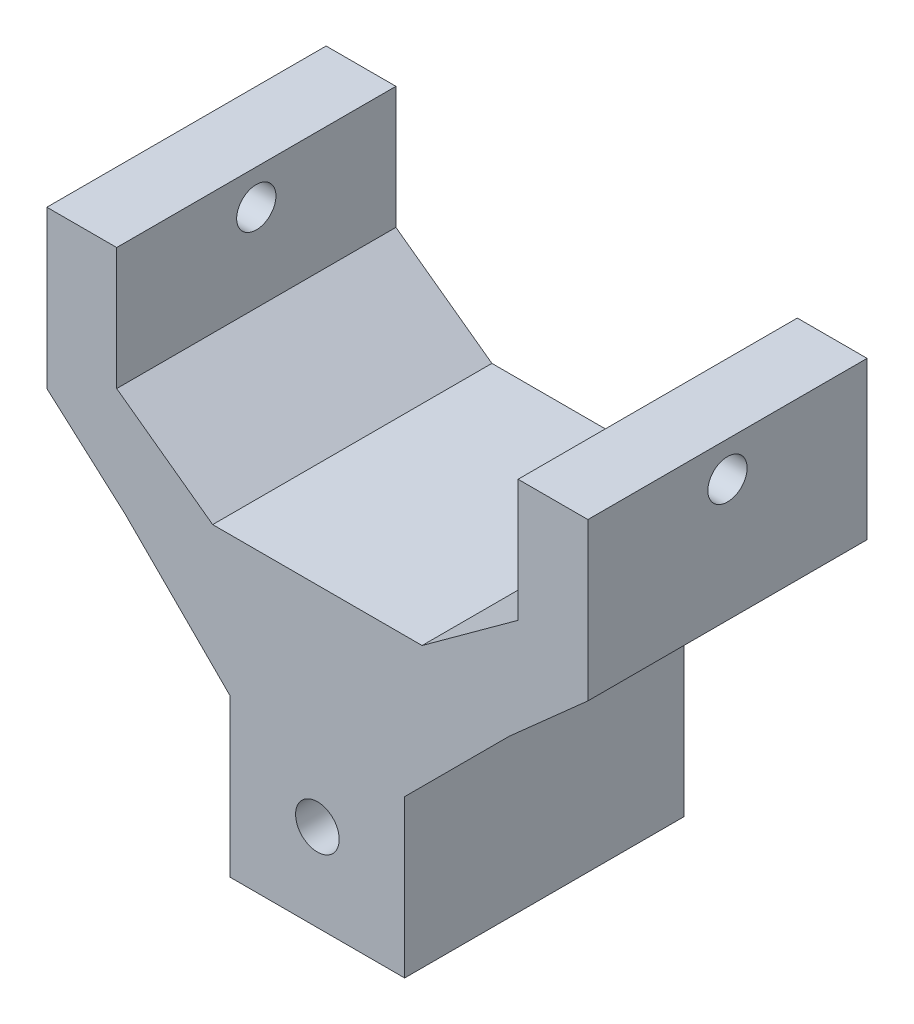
ISO-10303-21;
HEADER;
FILE_DESCRIPTION(('STEP AP214'),'2;1');
FILE_NAME('part.step','',(''),(''),'','','');
FILE_SCHEMA(('AUTOMOTIVE_DESIGN { 1 0 10303 214 1 1 1 1 }'));
ENDSEC;
DATA;
#1=APPLICATION_CONTEXT('core data for automotive mechanical design processes');
#2=APPLICATION_PROTOCOL_DEFINITION('international standard','automotive_design',2000,#1);
#3=PRODUCT_CONTEXT('',#1,'mechanical');
#4=PRODUCT('Part','Part','',(#3));
#5=PRODUCT_RELATED_PRODUCT_CATEGORY('part','',(#4));
#6=PRODUCT_DEFINITION_FORMATION('','',#4);
#7=PRODUCT_DEFINITION_CONTEXT('part definition',#1,'design');
#8=PRODUCT_DEFINITION('design','',#6,#7);
#9=PRODUCT_DEFINITION_SHAPE('','',#8);
#10=(LENGTH_UNIT() NAMED_UNIT(*) SI_UNIT(.MILLI.,.METRE.));
#11=(NAMED_UNIT(*) PLANE_ANGLE_UNIT() SI_UNIT($,.RADIAN.));
#12=(NAMED_UNIT(*) SI_UNIT($,.STERADIAN.) SOLID_ANGLE_UNIT());
#13=UNCERTAINTY_MEASURE_WITH_UNIT(LENGTH_MEASURE(1.E-05),#10,'distance_accuracy_value','');
#14=(GEOMETRIC_REPRESENTATION_CONTEXT(3) GLOBAL_UNCERTAINTY_ASSIGNED_CONTEXT((#13)) GLOBAL_UNIT_ASSIGNED_CONTEXT((#10,
#11,#12)) REPRESENTATION_CONTEXT('',''));
#15=CARTESIAN_POINT('',(0.,0.,0.));
#16=DIRECTION('',(0.,0.,1.));
#17=DIRECTION('',(1.,0.,0.));
#18=AXIS2_PLACEMENT_3D('',#15,#16,#17);
#19=CARTESIAN_POINT('',(-10.,-132.,-16.));
#20=DIRECTION('',(-1.,0.,0.));
#21=DIRECTION('',(0.,0.,1.));
#22=AXIS2_PLACEMENT_3D('',#19,#20,#21);
#23=PLANE('',#22);
#24=DIRECTION('',(0.,-1.,0.));
#25=VECTOR('',#24,1.);
#26=CARTESIAN_POINT('',(-10.,-132.,16.));
#27=LINE('',#26,#25);
#28=CARTESIAN_POINT('',(-10.,-132.,16.));
#29=VERTEX_POINT('',#28);
#30=CARTESIAN_POINT('',(-10.,-150.,16.));
#31=VERTEX_POINT('',#30);
#32=EDGE_CURVE('E187',#29,#31,#27,.T.);
#33=ORIENTED_EDGE('',*,*,#32,.F.);
#34=DIRECTION('',(0.,0.,1.));
#35=VECTOR('',#34,1.);
#36=CARTESIAN_POINT('',(-10.,-132.,-16.));
#37=LINE('',#36,#35);
#38=CARTESIAN_POINT('',(-10.,-132.,-16.));
#39=VERTEX_POINT('',#38);
#40=EDGE_CURVE('E11',#39,#29,#37,.T.);
#41=ORIENTED_EDGE('',*,*,#40,.F.);
#42=DIRECTION('',(0.,-1.,0.));
#43=VECTOR('',#42,1.);
#44=CARTESIAN_POINT('',(-10.,-132.,-16.));
#45=LINE('',#44,#43);
#46=CARTESIAN_POINT('',(-10.,-150.,-16.));
#47=VERTEX_POINT('',#46);
#48=EDGE_CURVE('E232',#39,#47,#45,.T.);
#49=ORIENTED_EDGE('',*,*,#48,.T.);
#50=DIRECTION('',(0.,0.,1.));
#51=VECTOR('',#50,1.);
#52=CARTESIAN_POINT('',(-10.,-150.,-16.));
#53=LINE('',#52,#51);
#54=EDGE_CURVE('E121',#47,#31,#53,.T.);
#55=ORIENTED_EDGE('',*,*,#54,.T.);
#56=EDGE_LOOP('',(#33,#41,#49,#55));
#57=FACE_BOUND('',#56,.T.);
#58=ADVANCED_FACE('F41',(#57),#23,.T.);
#59=CARTESIAN_POINT('',(-22.,-120.,-16.));
#60=DIRECTION('',(-0.707106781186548,-0.707106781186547,0.));
#61=DIRECTION('',(0.707106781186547,-0.707106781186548,0.));
#62=AXIS2_PLACEMENT_3D('',#59,#60,#61);
#63=PLANE('',#62);
#64=DIRECTION('',(0.707106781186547,-0.707106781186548,0.));
#65=VECTOR('',#64,1.);
#66=CARTESIAN_POINT('',(-22.,-120.,16.));
#67=LINE('',#66,#65);
#68=CARTESIAN_POINT('',(-22.,-120.,16.));
#69=VERTEX_POINT('',#68);
#70=EDGE_CURVE('E230',#69,#29,#67,.T.);
#71=ORIENTED_EDGE('',*,*,#70,.F.);
#72=DIRECTION('',(0.,0.,1.));
#73=VECTOR('',#72,1.);
#74=CARTESIAN_POINT('',(-22.,-120.,-16.));
#75=LINE('',#74,#73);
#76=CARTESIAN_POINT('',(-22.,-120.,-16.));
#77=VERTEX_POINT('',#76);
#78=EDGE_CURVE('E50',#77,#69,#75,.T.);
#79=ORIENTED_EDGE('',*,*,#78,.F.);
#80=DIRECTION('',(0.707106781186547,-0.707106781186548,0.));
#81=VECTOR('',#80,1.);
#82=CARTESIAN_POINT('',(-22.,-120.,-16.));
#83=LINE('',#82,#81);
#84=EDGE_CURVE('E177',#77,#39,#83,.T.);
#85=ORIENTED_EDGE('',*,*,#84,.T.);
#86=ORIENTED_EDGE('',*,*,#40,.T.);
#87=EDGE_LOOP('',(#71,#79,#85,#86));
#88=FACE_BOUND('',#87,.T.);
#89=ADVANCED_FACE('F349',(#88),#63,.T.);
#90=CARTESIAN_POINT('',(-31.,-112.,-16.));
#91=DIRECTION('',(-0.664363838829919,-0.74740931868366,0.));
#92=DIRECTION('',(0.74740931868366,-0.664363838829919,0.));
#93=AXIS2_PLACEMENT_3D('',#90,#91,#92);
#94=PLANE('',#93);
#95=DIRECTION('',(0.74740931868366,-0.664363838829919,0.));
#96=VECTOR('',#95,1.);
#97=CARTESIAN_POINT('',(-31.,-112.,16.));
#98=LINE('',#97,#96);
#99=CARTESIAN_POINT('',(-31.,-112.,16.));
#100=VERTEX_POINT('',#99);
#101=EDGE_CURVE('E164',#100,#69,#98,.T.);
#102=ORIENTED_EDGE('',*,*,#101,.F.);
#103=DIRECTION('',(0.,0.,1.));
#104=VECTOR('',#103,1.);
#105=CARTESIAN_POINT('',(-31.,-112.,-16.));
#106=LINE('',#105,#104);
#107=CARTESIAN_POINT('',(-31.,-112.,-16.));
#108=VERTEX_POINT('',#107);
#109=EDGE_CURVE('E159',#108,#100,#106,.T.);
#110=ORIENTED_EDGE('',*,*,#109,.F.);
#111=DIRECTION('',(0.74740931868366,-0.664363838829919,0.));
#112=VECTOR('',#111,1.);
#113=CARTESIAN_POINT('',(-31.,-112.,-16.));
#114=LINE('',#113,#112);
#115=EDGE_CURVE('E162',#108,#77,#114,.T.);
#116=ORIENTED_EDGE('',*,*,#115,.T.);
#117=ORIENTED_EDGE('',*,*,#78,.T.);
#118=EDGE_LOOP('',(#102,#110,#116,#117));
#119=FACE_BOUND('',#118,.T.);
#120=ADVANCED_FACE('F161',(#119),#94,.T.);
#121=CARTESIAN_POINT('',(-31.,-94.,-16.));
#122=DIRECTION('',(-1.,0.,0.));
#123=DIRECTION('',(0.,0.,1.));
#124=AXIS2_PLACEMENT_3D('',#121,#122,#123);
#125=PLANE('',#124);
#126=CARTESIAN_POINT('',(-31.,-98.,0.));
#127=DIRECTION('',(-1.,0.,0.));
#128=DIRECTION('',(0.,0.,1.));
#129=AXIS2_PLACEMENT_3D('',#126,#127,#128);
#130=CIRCLE('',#129,2.25);
#131=CARTESIAN_POINT('',(-31.,-98.,2.25));
#132=VERTEX_POINT('',#131);
#133=EDGE_CURVE('E260',#132,#132,#130,.T.);
#134=ORIENTED_EDGE('',*,*,#133,.F.);
#135=EDGE_LOOP('',(#134));
#136=FACE_BOUND('',#135,.T.);
#137=DIRECTION('',(0.,-1.,0.));
#138=VECTOR('',#137,1.);
#139=CARTESIAN_POINT('',(-31.,-94.,16.));
#140=LINE('',#139,#138);
#141=CARTESIAN_POINT('',(-31.,-94.,16.));
#142=VERTEX_POINT('',#141);
#143=EDGE_CURVE('E227',#142,#100,#140,.T.);
#144=ORIENTED_EDGE('',*,*,#143,.F.);
#145=DIRECTION('',(0.,0.,1.));
#146=VECTOR('',#145,1.);
#147=CARTESIAN_POINT('',(-31.,-94.,-16.));
#148=LINE('',#147,#146);
#149=CARTESIAN_POINT('',(-31.,-94.,-16.));
#150=VERTEX_POINT('',#149);
#151=EDGE_CURVE('E169',#150,#142,#148,.T.);
#152=ORIENTED_EDGE('',*,*,#151,.F.);
#153=DIRECTION('',(0.,-1.,0.));
#154=VECTOR('',#153,1.);
#155=CARTESIAN_POINT('',(-31.,-94.,-16.));
#156=LINE('',#155,#154);
#157=EDGE_CURVE('E175',#150,#108,#156,.T.);
#158=ORIENTED_EDGE('',*,*,#157,.T.);
#159=ORIENTED_EDGE('',*,*,#109,.T.);
#160=EDGE_LOOP('',(#144,#152,#158,#159));
#161=FACE_BOUND('',#160,.T.);
#162=ADVANCED_FACE('F179',(#136,#161),#125,.T.);
#163=CARTESIAN_POINT('',(-23.,-94.,-16.));
#164=DIRECTION('',(0.,1.,0.));
#165=DIRECTION('',(0.,0.,1.));
#166=AXIS2_PLACEMENT_3D('',#163,#164,#165);
#167=PLANE('',#166);
#168=DIRECTION('',(-1.,0.,0.));
#169=VECTOR('',#168,1.);
#170=CARTESIAN_POINT('',(-23.,-94.,16.));
#171=LINE('',#170,#169);
#172=CARTESIAN_POINT('',(-23.,-94.,16.));
#173=VERTEX_POINT('',#172);
#174=EDGE_CURVE('E224',#173,#142,#171,.T.);
#175=ORIENTED_EDGE('',*,*,#174,.F.);
#176=DIRECTION('',(0.,0.,1.));
#177=VECTOR('',#176,1.);
#178=CARTESIAN_POINT('',(-23.,-94.,-16.));
#179=LINE('',#178,#177);
#180=CARTESIAN_POINT('',(-23.,-94.,-16.));
#181=VERTEX_POINT('',#180);
#182=EDGE_CURVE('E236',#181,#173,#179,.T.);
#183=ORIENTED_EDGE('',*,*,#182,.F.);
#184=DIRECTION('',(-1.,0.,0.));
#185=VECTOR('',#184,1.);
#186=CARTESIAN_POINT('',(-23.,-94.,-16.));
#187=LINE('',#186,#185);
#188=EDGE_CURVE('E180',#181,#150,#187,.T.);
#189=ORIENTED_EDGE('',*,*,#188,.T.);
#190=ORIENTED_EDGE('',*,*,#151,.T.);
#191=EDGE_LOOP('',(#175,#183,#189,#190));
#192=FACE_BOUND('',#191,.T.);
#193=ADVANCED_FACE('F362',(#192),#167,.T.);
#194=CARTESIAN_POINT('',(-23.,-108.,-16.));
#195=DIRECTION('',(1.,0.,0.));
#196=DIRECTION('',(0.,0.,-1.));
#197=AXIS2_PLACEMENT_3D('',#194,#195,#196);
#198=PLANE('',#197);
#199=CARTESIAN_POINT('',(-23.,-98.,0.));
#200=DIRECTION('',(1.,0.,0.));
#201=DIRECTION('',(0.,0.,-1.));
#202=AXIS2_PLACEMENT_3D('',#199,#200,#201);
#203=CIRCLE('',#202,2.25);
#204=CARTESIAN_POINT('',(-23.,-98.,-2.25));
#205=VERTEX_POINT('',#204);
#206=EDGE_CURVE('E266',#205,#205,#203,.T.);
#207=ORIENTED_EDGE('',*,*,#206,.F.);
#208=EDGE_LOOP('',(#207));
#209=FACE_BOUND('',#208,.T.);
#210=DIRECTION('',(0.,1.,0.));
#211=VECTOR('',#210,1.);
#212=CARTESIAN_POINT('',(-23.,-108.,16.));
#213=LINE('',#212,#211);
#214=CARTESIAN_POINT('',(-23.,-108.,16.));
#215=VERTEX_POINT('',#214);
#216=EDGE_CURVE('E221',#215,#173,#213,.T.);
#217=ORIENTED_EDGE('',*,*,#216,.F.);
#218=DIRECTION('',(0.,0.,1.));
#219=VECTOR('',#218,1.);
#220=CARTESIAN_POINT('',(-23.,-108.,-16.));
#221=LINE('',#220,#219);
#222=CARTESIAN_POINT('',(-23.,-108.,-16.));
#223=VERTEX_POINT('',#222);
#224=EDGE_CURVE('E238',#223,#215,#221,.T.);
#225=ORIENTED_EDGE('',*,*,#224,.F.);
#226=DIRECTION('',(0.,1.,0.));
#227=VECTOR('',#226,1.);
#228=CARTESIAN_POINT('',(-23.,-108.,-16.));
#229=LINE('',#228,#227);
#230=EDGE_CURVE('E182',#223,#181,#229,.T.);
#231=ORIENTED_EDGE('',*,*,#230,.T.);
#232=ORIENTED_EDGE('',*,*,#182,.T.);
#233=EDGE_LOOP('',(#217,#225,#231,#232));
#234=FACE_BOUND('',#233,.T.);
#235=ADVANCED_FACE('F308',(#209,#234),#198,.T.);
#236=CARTESIAN_POINT('',(-12.,-116.,-16.));
#237=DIRECTION('',(0.588171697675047,0.808736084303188,0.));
#238=DIRECTION('',(-0.808736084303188,0.588171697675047,0.));
#239=AXIS2_PLACEMENT_3D('',#236,#237,#238);
#240=PLANE('',#239);
#241=DIRECTION('',(-0.808736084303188,0.588171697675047,0.));
#242=VECTOR('',#241,1.);
#243=CARTESIAN_POINT('',(-12.,-116.,16.));
#244=LINE('',#243,#242);
#245=CARTESIAN_POINT('',(-12.,-116.,16.));
#246=VERTEX_POINT('',#245);
#247=EDGE_CURVE('E218',#246,#215,#244,.T.);
#248=ORIENTED_EDGE('',*,*,#247,.F.);
#249=DIRECTION('',(0.,0.,1.));
#250=VECTOR('',#249,1.);
#251=CARTESIAN_POINT('',(-12.,-116.,-16.));
#252=LINE('',#251,#250);
#253=CARTESIAN_POINT('',(-12.,-116.,-16.));
#254=VERTEX_POINT('',#253);
#255=EDGE_CURVE('E240',#254,#246,#252,.T.);
#256=ORIENTED_EDGE('',*,*,#255,.F.);
#257=DIRECTION('',(-0.808736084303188,0.588171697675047,0.));
#258=VECTOR('',#257,1.);
#259=CARTESIAN_POINT('',(-12.,-116.,-16.));
#260=LINE('',#259,#258);
#261=EDGE_CURVE('E302',#254,#223,#260,.T.);
#262=ORIENTED_EDGE('',*,*,#261,.T.);
#263=ORIENTED_EDGE('',*,*,#224,.T.);
#264=EDGE_LOOP('',(#248,#256,#262,#263));
#265=FACE_BOUND('',#264,.T.);
#266=ADVANCED_FACE('F314',(#265),#240,.T.);
#267=CARTESIAN_POINT('',(12.,-116.,-16.));
#268=DIRECTION('',(0.,1.,0.));
#269=DIRECTION('',(0.,0.,1.));
#270=AXIS2_PLACEMENT_3D('',#267,#268,#269);
#271=PLANE('',#270);
#272=DIRECTION('',(-1.,0.,0.));
#273=VECTOR('',#272,1.);
#274=CARTESIAN_POINT('',(12.,-116.,16.));
#275=LINE('',#274,#273);
#276=CARTESIAN_POINT('',(12.,-116.,16.));
#277=VERTEX_POINT('',#276);
#278=EDGE_CURVE('E215',#277,#246,#275,.T.);
#279=ORIENTED_EDGE('',*,*,#278,.F.);
#280=DIRECTION('',(0.,0.,1.));
#281=VECTOR('',#280,1.);
#282=CARTESIAN_POINT('',(12.,-116.,-16.));
#283=LINE('',#282,#281);
#284=CARTESIAN_POINT('',(12.,-116.,-16.));
#285=VERTEX_POINT('',#284);
#286=EDGE_CURVE('E242',#285,#277,#283,.T.);
#287=ORIENTED_EDGE('',*,*,#286,.F.);
#288=DIRECTION('',(-1.,0.,0.));
#289=VECTOR('',#288,1.);
#290=CARTESIAN_POINT('',(12.,-116.,-16.));
#291=LINE('',#290,#289);
#292=EDGE_CURVE('E299',#285,#254,#291,.T.);
#293=ORIENTED_EDGE('',*,*,#292,.T.);
#294=ORIENTED_EDGE('',*,*,#255,.T.);
#295=EDGE_LOOP('',(#279,#287,#293,#294));
#296=FACE_BOUND('',#295,.T.);
#297=ADVANCED_FACE('F317',(#296),#271,.T.);
#298=CARTESIAN_POINT('',(23.,-108.,-16.));
#299=DIRECTION('',(-0.588171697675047,0.808736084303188,0.));
#300=DIRECTION('',(-0.808736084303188,-0.588171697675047,0.));
#301=AXIS2_PLACEMENT_3D('',#298,#299,#300);
#302=PLANE('',#301);
#303=DIRECTION('',(-0.808736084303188,-0.588171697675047,0.));
#304=VECTOR('',#303,1.);
#305=CARTESIAN_POINT('',(23.,-108.,16.));
#306=LINE('',#305,#304);
#307=CARTESIAN_POINT('',(23.,-108.,16.));
#308=VERTEX_POINT('',#307);
#309=EDGE_CURVE('E212',#308,#277,#306,.T.);
#310=ORIENTED_EDGE('',*,*,#309,.F.);
#311=DIRECTION('',(0.,0.,1.));
#312=VECTOR('',#311,1.);
#313=CARTESIAN_POINT('',(23.,-108.,-16.));
#314=LINE('',#313,#312);
#315=CARTESIAN_POINT('',(23.,-108.,-16.));
#316=VERTEX_POINT('',#315);
#317=EDGE_CURVE('E244',#316,#308,#314,.T.);
#318=ORIENTED_EDGE('',*,*,#317,.F.);
#319=DIRECTION('',(-0.808736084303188,-0.588171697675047,0.));
#320=VECTOR('',#319,1.);
#321=CARTESIAN_POINT('',(23.,-108.,-16.));
#322=LINE('',#321,#320);
#323=EDGE_CURVE('E296',#316,#285,#322,.T.);
#324=ORIENTED_EDGE('',*,*,#323,.T.);
#325=ORIENTED_EDGE('',*,*,#286,.T.);
#326=EDGE_LOOP('',(#310,#318,#324,#325));
#327=FACE_BOUND('',#326,.T.);
#328=ADVANCED_FACE('F322',(#327),#302,.T.);
#329=CARTESIAN_POINT('',(23.,-94.,-16.));
#330=DIRECTION('',(-1.,0.,0.));
#331=DIRECTION('',(0.,0.,1.));
#332=AXIS2_PLACEMENT_3D('',#329,#330,#331);
#333=PLANE('',#332);
#334=CARTESIAN_POINT('',(23.,-98.,0.));
#335=DIRECTION('',(-1.,0.,0.));
#336=DIRECTION('',(0.,0.,1.));
#337=AXIS2_PLACEMENT_3D('',#334,#335,#336);
#338=CIRCLE('',#337,2.25);
#339=CARTESIAN_POINT('',(23.,-98.,2.25));
#340=VERTEX_POINT('',#339);
#341=EDGE_CURVE('E271',#340,#340,#338,.T.);
#342=ORIENTED_EDGE('',*,*,#341,.F.);
#343=EDGE_LOOP('',(#342));
#344=FACE_BOUND('',#343,.T.);
#345=DIRECTION('',(0.,-1.,0.));
#346=VECTOR('',#345,1.);
#347=CARTESIAN_POINT('',(23.,-94.,16.));
#348=LINE('',#347,#346);
#349=CARTESIAN_POINT('',(23.,-94.,16.));
#350=VERTEX_POINT('',#349);
#351=EDGE_CURVE('E209',#350,#308,#348,.T.);
#352=ORIENTED_EDGE('',*,*,#351,.F.);
#353=DIRECTION('',(0.,0.,1.));
#354=VECTOR('',#353,1.);
#355=CARTESIAN_POINT('',(23.,-94.,-16.));
#356=LINE('',#355,#354);
#357=CARTESIAN_POINT('',(23.,-94.,-16.));
#358=VERTEX_POINT('',#357);
#359=EDGE_CURVE('E246',#358,#350,#356,.T.);
#360=ORIENTED_EDGE('',*,*,#359,.F.);
#361=DIRECTION('',(0.,-1.,0.));
#362=VECTOR('',#361,1.);
#363=CARTESIAN_POINT('',(23.,-94.,-16.));
#364=LINE('',#363,#362);
#365=EDGE_CURVE('E293',#358,#316,#364,.T.);
#366=ORIENTED_EDGE('',*,*,#365,.T.);
#367=ORIENTED_EDGE('',*,*,#317,.T.);
#368=EDGE_LOOP('',(#352,#360,#366,#367));
#369=FACE_BOUND('',#368,.T.);
#370=ADVANCED_FACE('F325',(#344,#369),#333,.T.);
#371=CARTESIAN_POINT('',(31.,-94.,-16.));
#372=DIRECTION('',(0.,1.,0.));
#373=DIRECTION('',(0.,0.,1.));
#374=AXIS2_PLACEMENT_3D('',#371,#372,#373);
#375=PLANE('',#374);
#376=DIRECTION('',(-1.,0.,0.));
#377=VECTOR('',#376,1.);
#378=CARTESIAN_POINT('',(31.,-94.,16.));
#379=LINE('',#378,#377);
#380=CARTESIAN_POINT('',(31.,-94.,16.));
#381=VERTEX_POINT('',#380);
#382=EDGE_CURVE('E206',#381,#350,#379,.T.);
#383=ORIENTED_EDGE('',*,*,#382,.F.);
#384=DIRECTION('',(0.,0.,1.));
#385=VECTOR('',#384,1.);
#386=CARTESIAN_POINT('',(31.,-94.,-16.));
#387=LINE('',#386,#385);
#388=CARTESIAN_POINT('',(31.,-94.,-16.));
#389=VERTEX_POINT('',#388);
#390=EDGE_CURVE('E248',#389,#381,#387,.T.);
#391=ORIENTED_EDGE('',*,*,#390,.F.);
#392=DIRECTION('',(-1.,0.,0.));
#393=VECTOR('',#392,1.);
#394=CARTESIAN_POINT('',(31.,-94.,-16.));
#395=LINE('',#394,#393);
#396=EDGE_CURVE('E290',#389,#358,#395,.T.);
#397=ORIENTED_EDGE('',*,*,#396,.T.);
#398=ORIENTED_EDGE('',*,*,#359,.T.);
#399=EDGE_LOOP('',(#383,#391,#397,#398));
#400=FACE_BOUND('',#399,.T.);
#401=ADVANCED_FACE('F330',(#400),#375,.T.);
#402=CARTESIAN_POINT('',(31.,-112.,-16.));
#403=DIRECTION('',(1.,0.,0.));
#404=DIRECTION('',(0.,0.,-1.));
#405=AXIS2_PLACEMENT_3D('',#402,#403,#404);
#406=PLANE('',#405);
#407=CARTESIAN_POINT('',(31.,-98.,0.));
#408=DIRECTION('',(1.,0.,0.));
#409=DIRECTION('',(0.,0.,-1.));
#410=AXIS2_PLACEMENT_3D('',#407,#408,#409);
#411=CIRCLE('',#410,2.25);
#412=CARTESIAN_POINT('',(31.,-98.,-2.25));
#413=VERTEX_POINT('',#412);
#414=EDGE_CURVE('E44',#413,#413,#411,.T.);
#415=ORIENTED_EDGE('',*,*,#414,.F.);
#416=EDGE_LOOP('',(#415));
#417=FACE_BOUND('',#416,.T.);
#418=DIRECTION('',(0.,1.,0.));
#419=VECTOR('',#418,1.);
#420=CARTESIAN_POINT('',(31.,-112.,16.));
#421=LINE('',#420,#419);
#422=CARTESIAN_POINT('',(31.,-112.,16.));
#423=VERTEX_POINT('',#422);
#424=EDGE_CURVE('E203',#423,#381,#421,.T.);
#425=ORIENTED_EDGE('',*,*,#424,.F.);
#426=DIRECTION('',(0.,0.,1.));
#427=VECTOR('',#426,1.);
#428=CARTESIAN_POINT('',(31.,-112.,-16.));
#429=LINE('',#428,#427);
#430=CARTESIAN_POINT('',(31.,-112.,-16.));
#431=VERTEX_POINT('',#430);
#432=EDGE_CURVE('E250',#431,#423,#429,.T.);
#433=ORIENTED_EDGE('',*,*,#432,.F.);
#434=DIRECTION('',(0.,1.,0.));
#435=VECTOR('',#434,1.);
#436=CARTESIAN_POINT('',(31.,-112.,-16.));
#437=LINE('',#436,#435);
#438=EDGE_CURVE('E287',#431,#389,#437,.T.);
#439=ORIENTED_EDGE('',*,*,#438,.T.);
#440=ORIENTED_EDGE('',*,*,#390,.T.);
#441=EDGE_LOOP('',(#425,#433,#439,#440));
#442=FACE_BOUND('',#441,.T.);
#443=ADVANCED_FACE('F333',(#417,#442),#406,.T.);
#444=CARTESIAN_POINT('',(22.,-120.,-16.));
#445=DIRECTION('',(0.664363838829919,-0.74740931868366,0.));
#446=DIRECTION('',(0.74740931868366,0.664363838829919,0.));
#447=AXIS2_PLACEMENT_3D('',#444,#445,#446);
#448=PLANE('',#447);
#449=DIRECTION('',(0.74740931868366,0.664363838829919,0.));
#450=VECTOR('',#449,1.);
#451=CARTESIAN_POINT('',(22.,-120.,16.));
#452=LINE('',#451,#450);
#453=CARTESIAN_POINT('',(22.,-120.,16.));
#454=VERTEX_POINT('',#453);
#455=EDGE_CURVE('E200',#454,#423,#452,.T.);
#456=ORIENTED_EDGE('',*,*,#455,.F.);
#457=DIRECTION('',(0.,0.,1.));
#458=VECTOR('',#457,1.);
#459=CARTESIAN_POINT('',(22.,-120.,-16.));
#460=LINE('',#459,#458);
#461=CARTESIAN_POINT('',(22.,-120.,-16.));
#462=VERTEX_POINT('',#461);
#463=EDGE_CURVE('E252',#462,#454,#460,.T.);
#464=ORIENTED_EDGE('',*,*,#463,.F.);
#465=DIRECTION('',(0.74740931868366,0.664363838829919,0.));
#466=VECTOR('',#465,1.);
#467=CARTESIAN_POINT('',(22.,-120.,-16.));
#468=LINE('',#467,#466);
#469=EDGE_CURVE('E284',#462,#431,#468,.T.);
#470=ORIENTED_EDGE('',*,*,#469,.T.);
#471=ORIENTED_EDGE('',*,*,#432,.T.);
#472=EDGE_LOOP('',(#456,#464,#470,#471));
#473=FACE_BOUND('',#472,.T.);
#474=ADVANCED_FACE('F338',(#473),#448,.T.);
#475=CARTESIAN_POINT('',(10.,-132.,-16.));
#476=DIRECTION('',(0.707106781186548,-0.707106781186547,0.));
#477=DIRECTION('',(0.707106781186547,0.707106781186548,0.));
#478=AXIS2_PLACEMENT_3D('',#475,#476,#477);
#479=PLANE('',#478);
#480=DIRECTION('',(0.707106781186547,0.707106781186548,0.));
#481=VECTOR('',#480,1.);
#482=CARTESIAN_POINT('',(10.,-132.,16.));
#483=LINE('',#482,#481);
#484=CARTESIAN_POINT('',(10.,-132.,16.));
#485=VERTEX_POINT('',#484);
#486=EDGE_CURVE('E197',#485,#454,#483,.T.);
#487=ORIENTED_EDGE('',*,*,#486,.F.);
#488=DIRECTION('',(0.,0.,1.));
#489=VECTOR('',#488,1.);
#490=CARTESIAN_POINT('',(10.,-132.,-16.));
#491=LINE('',#490,#489);
#492=CARTESIAN_POINT('',(10.,-132.,-16.));
#493=VERTEX_POINT('',#492);
#494=EDGE_CURVE('E254',#493,#485,#491,.T.);
#495=ORIENTED_EDGE('',*,*,#494,.F.);
#496=DIRECTION('',(0.707106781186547,0.707106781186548,0.));
#497=VECTOR('',#496,1.);
#498=CARTESIAN_POINT('',(10.,-132.,-16.));
#499=LINE('',#498,#497);
#500=EDGE_CURVE('E281',#493,#462,#499,.T.);
#501=ORIENTED_EDGE('',*,*,#500,.T.);
#502=ORIENTED_EDGE('',*,*,#463,.T.);
#503=EDGE_LOOP('',(#487,#495,#501,#502));
#504=FACE_BOUND('',#503,.T.);
#505=ADVANCED_FACE('F341',(#504),#479,.T.);
#506=CARTESIAN_POINT('',(10.,-150.,-16.));
#507=DIRECTION('',(1.,0.,0.));
#508=DIRECTION('',(0.,0.,-1.));
#509=AXIS2_PLACEMENT_3D('',#506,#507,#508);
#510=PLANE('',#509);
#511=DIRECTION('',(0.,1.,0.));
#512=VECTOR('',#511,1.);
#513=CARTESIAN_POINT('',(10.,-150.,16.));
#514=LINE('',#513,#512);
#515=CARTESIAN_POINT('',(10.,-150.,16.));
#516=VERTEX_POINT('',#515);
#517=EDGE_CURVE('E194',#516,#485,#514,.T.);
#518=ORIENTED_EDGE('',*,*,#517,.F.);
#519=DIRECTION('',(0.,0.,1.));
#520=VECTOR('',#519,1.);
#521=CARTESIAN_POINT('',(10.,-150.,-16.));
#522=LINE('',#521,#520);
#523=CARTESIAN_POINT('',(10.,-150.,-16.));
#524=VERTEX_POINT('',#523);
#525=EDGE_CURVE('E256',#524,#516,#522,.T.);
#526=ORIENTED_EDGE('',*,*,#525,.F.);
#527=DIRECTION('',(0.,1.,0.));
#528=VECTOR('',#527,1.);
#529=CARTESIAN_POINT('',(10.,-150.,-16.));
#530=LINE('',#529,#528);
#531=EDGE_CURVE('E278',#524,#493,#530,.T.);
#532=ORIENTED_EDGE('',*,*,#531,.T.);
#533=ORIENTED_EDGE('',*,*,#494,.T.);
#534=EDGE_LOOP('',(#518,#526,#532,#533));
#535=FACE_BOUND('',#534,.T.);
#536=ADVANCED_FACE('F345',(#535),#510,.T.);
#537=CARTESIAN_POINT('',(-10.,-150.,-16.));
#538=DIRECTION('',(0.,-1.,0.));
#539=DIRECTION('',(0.,0.,-1.));
#540=AXIS2_PLACEMENT_3D('',#537,#538,#539);
#541=PLANE('',#540);
#542=DIRECTION('',(1.,0.,0.));
#543=VECTOR('',#542,1.);
#544=CARTESIAN_POINT('',(-10.,-150.,16.));
#545=LINE('',#544,#543);
#546=EDGE_CURVE('E190',#31,#516,#545,.T.);
#547=ORIENTED_EDGE('',*,*,#546,.F.);
#548=ORIENTED_EDGE('',*,*,#54,.F.);
#549=DIRECTION('',(1.,0.,0.));
#550=VECTOR('',#549,1.);
#551=CARTESIAN_POINT('',(-10.,-150.,-16.));
#552=LINE('',#551,#550);
#553=EDGE_CURVE('E276',#47,#524,#552,.T.);
#554=ORIENTED_EDGE('',*,*,#553,.T.);
#555=ORIENTED_EDGE('',*,*,#525,.T.);
#556=EDGE_LOOP('',(#547,#548,#554,#555));
#557=FACE_BOUND('',#556,.T.);
#558=ADVANCED_FACE('F346',(#557),#541,.T.);
#559=CARTESIAN_POINT('',(0.,0.,-16.));
#560=DIRECTION('',(0.,0.,1.));
#561=DIRECTION('',(1.,0.,0.));
#562=AXIS2_PLACEMENT_3D('',#559,#560,#561);
#563=PLANE('',#562);
#564=CARTESIAN_POINT('',(0.,-140.,-16.));
#565=DIRECTION('',(0.,0.,1.));
#566=DIRECTION('',(1.,0.,0.));
#567=AXIS2_PLACEMENT_3D('',#564,#565,#566);
#568=CIRCLE('',#567,2.5);
#569=CARTESIAN_POINT('',(2.5,-140.,-16.));
#570=VERTEX_POINT('',#569);
#571=EDGE_CURVE('E191',#570,#570,#568,.T.);
#572=ORIENTED_EDGE('',*,*,#571,.T.);
#573=EDGE_LOOP('',(#572));
#574=FACE_BOUND('',#573,.T.);
#575=ORIENTED_EDGE('',*,*,#48,.F.);
#576=ORIENTED_EDGE('',*,*,#84,.F.);
#577=ORIENTED_EDGE('',*,*,#115,.F.);
#578=ORIENTED_EDGE('',*,*,#157,.F.);
#579=ORIENTED_EDGE('',*,*,#188,.F.);
#580=ORIENTED_EDGE('',*,*,#230,.F.);
#581=ORIENTED_EDGE('',*,*,#261,.F.);
#582=ORIENTED_EDGE('',*,*,#292,.F.);
#583=ORIENTED_EDGE('',*,*,#323,.F.);
#584=ORIENTED_EDGE('',*,*,#365,.F.);
#585=ORIENTED_EDGE('',*,*,#396,.F.);
#586=ORIENTED_EDGE('',*,*,#438,.F.);
#587=ORIENTED_EDGE('',*,*,#469,.F.);
#588=ORIENTED_EDGE('',*,*,#500,.F.);
#589=ORIENTED_EDGE('',*,*,#531,.F.);
#590=ORIENTED_EDGE('',*,*,#553,.F.);
#591=EDGE_LOOP('',(#575,#576,#577,#578,#579,#580,#581,#582,#583,#584,#585,#586,#587,#588,#589,#590));
#592=FACE_BOUND('',#591,.T.);
#593=ADVANCED_FACE('F173',(#574,#592),#563,.F.);
#594=CARTESIAN_POINT('',(0.,0.,16.));
#595=DIRECTION('',(0.,0.,1.));
#596=DIRECTION('',(1.,0.,0.));
#597=AXIS2_PLACEMENT_3D('',#594,#595,#596);
#598=PLANE('',#597);
#599=CARTESIAN_POINT('',(0.,-140.,16.));
#600=DIRECTION('',(0.,0.,1.));
#601=DIRECTION('',(1.,0.,0.));
#602=AXIS2_PLACEMENT_3D('',#599,#600,#601);
#603=CIRCLE('',#602,2.5);
#604=CARTESIAN_POINT('',(2.5,-140.,16.));
#605=VERTEX_POINT('',#604);
#606=EDGE_CURVE('E258',#605,#605,#603,.T.);
#607=ORIENTED_EDGE('',*,*,#606,.F.);
#608=EDGE_LOOP('',(#607));
#609=FACE_BOUND('',#608,.T.);
#610=ORIENTED_EDGE('',*,*,#32,.T.);
#611=ORIENTED_EDGE('',*,*,#546,.T.);
#612=ORIENTED_EDGE('',*,*,#517,.T.);
#613=ORIENTED_EDGE('',*,*,#486,.T.);
#614=ORIENTED_EDGE('',*,*,#455,.T.);
#615=ORIENTED_EDGE('',*,*,#424,.T.);
#616=ORIENTED_EDGE('',*,*,#382,.T.);
#617=ORIENTED_EDGE('',*,*,#351,.T.);
#618=ORIENTED_EDGE('',*,*,#309,.T.);
#619=ORIENTED_EDGE('',*,*,#278,.T.);
#620=ORIENTED_EDGE('',*,*,#247,.T.);
#621=ORIENTED_EDGE('',*,*,#216,.T.);
#622=ORIENTED_EDGE('',*,*,#174,.T.);
#623=ORIENTED_EDGE('',*,*,#143,.T.);
#624=ORIENTED_EDGE('',*,*,#101,.T.);
#625=ORIENTED_EDGE('',*,*,#70,.T.);
#626=EDGE_LOOP('',(#610,#611,#612,#613,#614,#615,#616,#617,#618,#619,#620,#621,#622,#623,#624,#625));
#627=FACE_BOUND('',#626,.T.);
#628=ADVANCED_FACE('F348',(#609,#627),#598,.T.);
#629=CARTESIAN_POINT('',(0.,-140.,-250.));
#630=DIRECTION('',(0.,0.,1.));
#631=DIRECTION('',(1.,0.,0.));
#632=AXIS2_PLACEMENT_3D('',#629,#630,#631);
#633=CYLINDRICAL_SURFACE('',#632,2.5);
#634=ORIENTED_EDGE('',*,*,#606,.T.);
#635=EDGE_LOOP('',(#634));
#636=FACE_BOUND('',#635,.T.);
#637=ORIENTED_EDGE('',*,*,#571,.F.);
#638=EDGE_LOOP('',(#637));
#639=FACE_BOUND('',#638,.T.);
#640=ADVANCED_FACE('F397',(#636,#639),#633,.F.);
#641=CARTESIAN_POINT('',(-250.,-98.,0.));
#642=DIRECTION('',(1.,0.,0.));
#643=DIRECTION('',(0.,0.,-1.));
#644=AXIS2_PLACEMENT_3D('',#641,#642,#643);
#645=CYLINDRICAL_SURFACE('',#644,2.25);
#646=ORIENTED_EDGE('',*,*,#341,.T.);
#647=EDGE_LOOP('',(#646));
#648=FACE_BOUND('',#647,.T.);
#649=ORIENTED_EDGE('',*,*,#414,.T.);
#650=EDGE_LOOP('',(#649));
#651=FACE_BOUND('',#650,.T.);
#652=ADVANCED_FACE('F402',(#648,#651),#645,.F.);
#653=ORIENTED_EDGE('',*,*,#133,.T.);
#654=EDGE_LOOP('',(#653));
#655=FACE_BOUND('',#654,.T.);
#656=ORIENTED_EDGE('',*,*,#206,.T.);
#657=EDGE_LOOP('',(#656));
#658=FACE_BOUND('',#657,.T.);
#659=ADVANCED_FACE('F404',(#655,#658),#645,.F.);
#660=CLOSED_SHELL('',(#58,#89,#120,#162,#193,#235,#266,#297,#328,#370,#401,#443,#474,#505,#536,
#558,#593,#628,#640,#652,#659));
#661=MANIFOLD_SOLID_BREP('B2',#660);
#662=ADVANCED_BREP_SHAPE_REPRESENTATION('',(#18,#661),#14);
#663=SHAPE_DEFINITION_REPRESENTATION(#9,#662);
ENDSEC;
END-ISO-10303-21;
